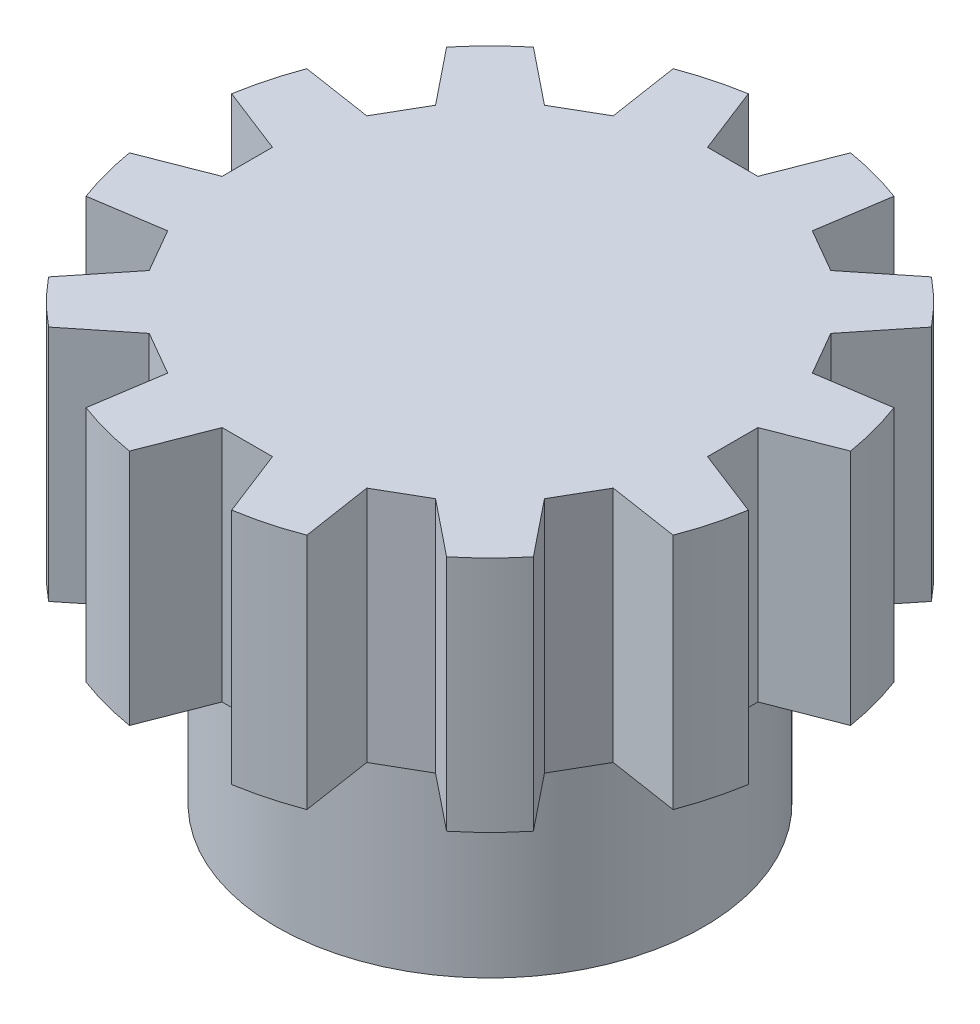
from build123d import *

# Parameters (mm, degrees)
CUT_EXTRUDE2_REACH = 19.55
CIRPATTERN1_COUNT  = 12


with BuildPart() as part:
    # Sketch1 → Revolve1 (revolve)
    with BuildSketch(Plane.XY, mode=Mode.PRIVATE) as revolve1_sk:
        Polygon((6.7945, 55.894079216), (6.7945, 47.625), (2.7305, 47.625), (2.7305, 51.371485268), (0.8255, 51.371485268), (0.8255, 55.894079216), align=None)
    revolve(revolve1_sk.sketch.rotate(Axis((6.7945, 45.4025, 0), (0, 1, 0)), 270), axis=Axis((6.7945, 45.4025, 0), (0, 1, 0)))

    # Sketch2 → Cut-Extrude2 (cut, up to next)
    with BuildSketch(Plane(origin=(-1.519613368, 55.894079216, 0), x_dir=(-1, 0, 0), z_dir=(0, 1, 0)), mode=Mode.PRIVATE) as cut_extrude2_sk1:
        with BuildLine():
            Line((-3.694980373, 0.479092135), (-2.424980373, 0.973177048))
            ThreePointArc((-2.424980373, 0.973177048), (-2.345113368, 0), (-2.424980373, -0.973177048))
            Line((-2.424980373, -0.973177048), (-3.694980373, -0.479092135))
            Line((-3.694980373, -0.479092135), (-3.694980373, 0.479092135))
        make_face()
    cut_extrude2_tool1 = extrude(cut_extrude2_sk1.sketch, amount=-CUT_EXTRUDE2_REACH, mode=Mode.PRIVATE) & part.part
    cut_extrude2 = cut_extrude2_tool1.solids().sort_by_distance((1.436663, 55.894079, 0))[0]
    add(cut_extrude2, mode=Mode.SUBTRACT)

    # CirPattern1: Cut-Extrude2 ×12 about axis
    cirpattern1_axis = Axis((6.7945, 0, 0), (0, 1, 0))
    for i in range(1, CIRPATTERN1_COUNT):
        add(cut_extrude2.rotate(cirpattern1_axis, i * 360 / CIRPATTERN1_COUNT), mode=Mode.SUBTRACT)


solid = part.part
